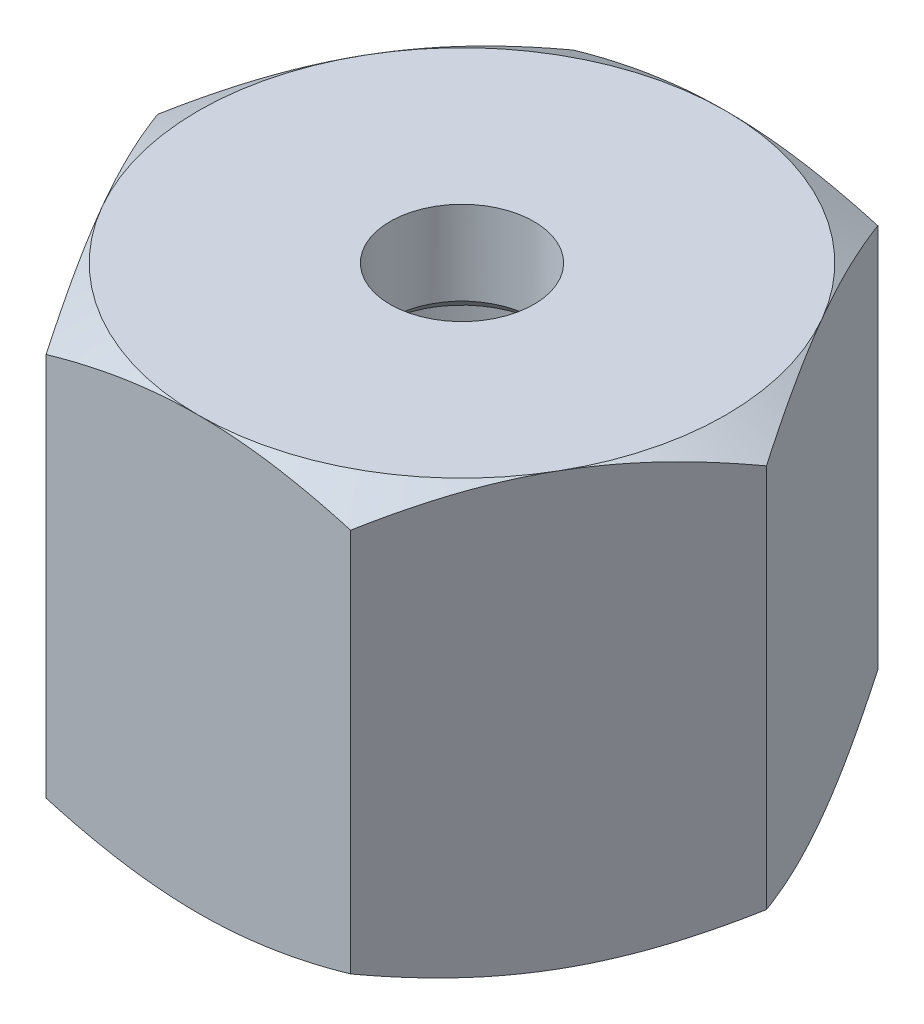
from build123d import *

# Parameters (mm, degrees)
P_IDAT_VYSUNUT_M1_DEPTH  = 18
SKICA2_OUTSIDE_W         = 38.492
SKICA2_OUTSIDE_H         = 35.088
SKICA2_OUTSIDE_R         = 11
ODEBRAT_VYSUNUT_M1_DEPTH = 1
ODEBRAT_VYSUNUT_M1_DRAFT = -60
SKICA3_OUTSIDE_W         = 38.492
SKICA3_OUTSIDE_H         = 35.088
SKICA3_OUTSIDE_R         = 11
ODEBRAT_VYSUNUT_M2_DEPTH = 1
ODEBRAT_VYSUNUT_M2_DRAFT = -60
SKICA4_R                 = 7.75
ODEBRAT_VYSUNUT_M3_DEPTH = 14
ZKOSEN_2_SIZE            = 0.35
ODEBRAT_VYSUNUT_M4_REACH = 26.624
SKICA5_R                 = 3
ZKOSEN_3_SIZE            = 0.5


with BuildPart() as part:
    # Skica1 → P_idat vysunut_m1 (new body)
    with BuildSketch(Plane(origin=(0, 0, 0), x_dir=(1, 0, 0), z_dir=(0, 1, 0))):
        Polygon((12.701705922, 0), (6.350852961, 11), (-6.350852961, 11), (-12.701705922, 0), (-6.350852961, -11), (6.350852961, -11), align=None)
    extrude(amount=P_IDAT_VYSUNUT_M1_DEPTH)


with BuildPart() as odebrat_vysunut_m1_tool:
    # Skica2 outside → Odebrat vysunut_m1 (with draft: the straight prism first)
    with BuildSketch(Plane(origin=(0, 18, 0), x_dir=(1, 0, 0), z_dir=(0, 1, 0))):
        Rectangle(SKICA2_OUTSIDE_W, SKICA2_OUTSIDE_H)
        Circle(SKICA2_OUTSIDE_R, mode=Mode.SUBTRACT)
    extrude(amount=-ODEBRAT_VYSUNUT_M1_DEPTH)
    # Odebrat vysunut_m1: the draft: its side faces are tilted about the plane it starts from
    odebrat_vysunut_m1_sides = [odebrat_vysunut_m1_tool.faces().sort_by_distance(p)[0] for p in [
        (0, 17.5, 17.544),
        (19.246, 17.5, 0),
        (0, 17.5, -17.544),
        (-19.246, 17.5, 0),
        (-11, 17.5, 0),
    ]]
    draft(odebrat_vysunut_m1_sides, Plane(origin=(0, 18, 0), x_dir=(1, 0, 0), z_dir=(0, 1, 0)), ODEBRAT_VYSUNUT_M1_DRAFT)


with BuildPart() as part_1:
    add(part.part)

    # Odebrat vysunut_m1: cut by odebrat_vysunut_m1_tool
    add(odebrat_vysunut_m1_tool.part, mode=Mode.SUBTRACT)


with BuildPart() as odebrat_vysunut_m2_tool:
    # Skica3 outside → Odebrat vysunut_m2 (with draft: the straight prism first)
    with BuildSketch(Plane.XZ):
        Rectangle(SKICA3_OUTSIDE_W, SKICA3_OUTSIDE_H)
        Circle(SKICA3_OUTSIDE_R, mode=Mode.SUBTRACT)
    extrude(amount=-ODEBRAT_VYSUNUT_M2_DEPTH)
    # Odebrat vysunut_m2: the draft: its side faces are tilted about the plane it starts from
    odebrat_vysunut_m2_sides = [odebrat_vysunut_m2_tool.faces().sort_by_distance(p)[0] for p in [
        (0, 0.5, -17.544),
        (19.246, 0.5, 0),
        (0, 0.5, 17.544),
        (-19.246, 0.5, 0),
        (-11, 0.5, 0),
    ]]
    draft(odebrat_vysunut_m2_sides, Plane.XZ, ODEBRAT_VYSUNUT_M2_DRAFT)


with BuildPart() as part_2:
    add(part_1.part)

    # Odebrat vysunut_m2: cut by odebrat_vysunut_m2_tool
    add(odebrat_vysunut_m2_tool.part, mode=Mode.SUBTRACT)

    # Skica4 → Odebrat vysunut_m3 (cut)
    with BuildSketch(Plane.XZ):
        with Locations(Location((0, 0, 0), (0, 0, 270))):
            Circle(SKICA4_R)
    extrude(amount=-ODEBRAT_VYSUNUT_M3_DEPTH, mode=Mode.SUBTRACT)

    # Zkosen_2
    zkosen_2_edges = [part_2.edges().sort_by_distance(p)[0] for p in [
        (0, 0, 7.75),
    ]]
    chamfer(zkosen_2_edges, length=ZKOSEN_2_SIZE)

    # Skica5 → Odebrat vysunut_m4 (cut, up to next)
    with BuildSketch(Plane(origin=(0, 18, 0), x_dir=(1, 0, 0), z_dir=(0, 1, 0)), mode=Mode.PRIVATE) as odebrat_vysunut_m4_sk1:
        with Locations(Location((0, 0, 0), (0, 0, 270))):
            Circle(SKICA5_R)
    odebrat_vysunut_m4_tool1 = extrude(odebrat_vysunut_m4_sk1.sketch, amount=-ODEBRAT_VYSUNUT_M4_REACH, mode=Mode.PRIVATE) & part_2.part
    add(odebrat_vysunut_m4_tool1.solids().sort_by_distance((0, 18, 0))[0], mode=Mode.SUBTRACT)

    # Zkosen_3
    zkosen_3_edges = [part_2.edges().sort_by_distance(p)[0] for p in [
        (0, 14, -3),
    ]]
    chamfer(zkosen_3_edges, length=ZKOSEN_3_SIZE)


solid = part_2.part
